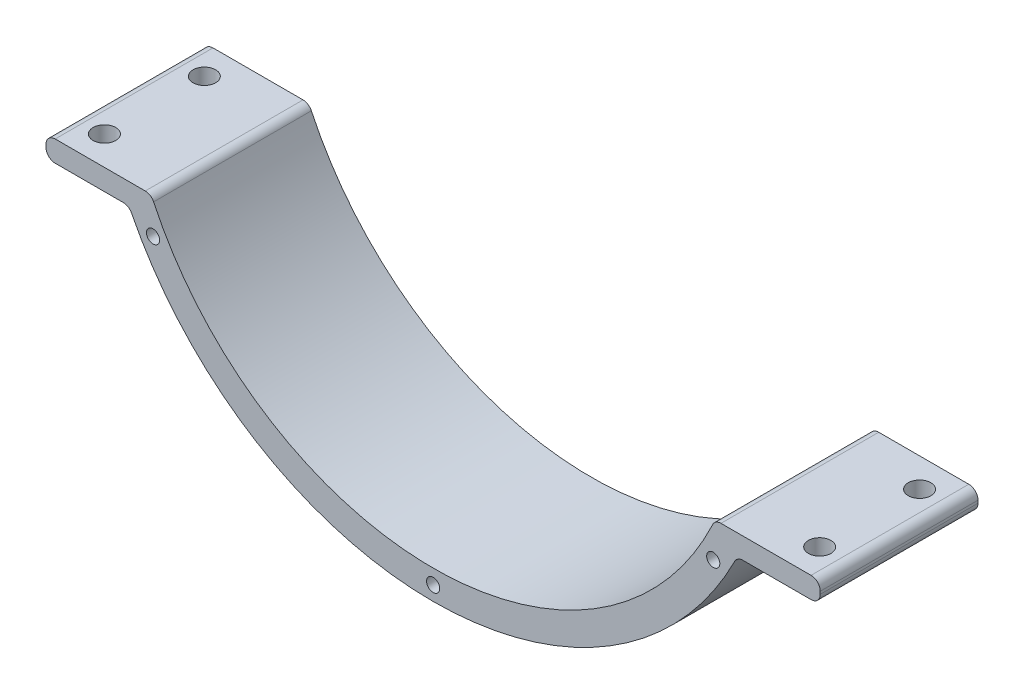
ISO-10303-21;
HEADER;
FILE_DESCRIPTION(('STEP AP214'),'2;1');
FILE_NAME('part.step','',(''),(''),'','','');
FILE_SCHEMA(('AUTOMOTIVE_DESIGN { 1 0 10303 214 1 1 1 1 }'));
ENDSEC;
DATA;
#1=APPLICATION_CONTEXT('core data for automotive mechanical design processes');
#2=APPLICATION_PROTOCOL_DEFINITION('international standard','automotive_design',2000,#1);
#3=PRODUCT_CONTEXT('',#1,'mechanical');
#4=PRODUCT('Part','Part','',(#3));
#5=PRODUCT_RELATED_PRODUCT_CATEGORY('part','',(#4));
#6=PRODUCT_DEFINITION_FORMATION('','',#4);
#7=PRODUCT_DEFINITION_CONTEXT('part definition',#1,'design');
#8=PRODUCT_DEFINITION('design','',#6,#7);
#9=PRODUCT_DEFINITION_SHAPE('','',#8);
#10=(LENGTH_UNIT() NAMED_UNIT(*) SI_UNIT(.MILLI.,.METRE.));
#11=(NAMED_UNIT(*) PLANE_ANGLE_UNIT() SI_UNIT($,.RADIAN.));
#12=(NAMED_UNIT(*) SI_UNIT($,.STERADIAN.) SOLID_ANGLE_UNIT());
#13=UNCERTAINTY_MEASURE_WITH_UNIT(LENGTH_MEASURE(1.E-05),#10,'distance_accuracy_value','');
#14=(GEOMETRIC_REPRESENTATION_CONTEXT(3) GLOBAL_UNCERTAINTY_ASSIGNED_CONTEXT((#13)) GLOBAL_UNIT_ASSIGNED_CONTEXT((#10,
#11,#12)) REPRESENTATION_CONTEXT('',''));
#15=CARTESIAN_POINT('',(0.,0.,0.));
#16=DIRECTION('',(0.,0.,1.));
#17=DIRECTION('',(1.,0.,0.));
#18=AXIS2_PLACEMENT_3D('',#15,#16,#17);
#19=CARTESIAN_POINT('',(0.,-24.,15.));
#20=DIRECTION('',(0.,-1.,0.));
#21=DIRECTION('',(1.,0.,0.));
#22=AXIS2_PLACEMENT_3D('',#19,#20,#21);
#23=PLANE('',#22);
#24=CARTESIAN_POINT('',(-68.,-24.,9.5));
#25=DIRECTION('',(0.,-1.,0.));
#26=DIRECTION('',(0.,0.,1.));
#27=AXIS2_PLACEMENT_3D('',#24,#25,#26);
#28=CIRCLE('',#27,2.15);
#29=CARTESIAN_POINT('',(-68.,-24.,11.65));
#30=VERTEX_POINT('',#29);
#31=EDGE_CURVE('E236',#30,#30,#28,.T.);
#32=ORIENTED_EDGE('',*,*,#31,.T.);
#33=EDGE_LOOP('',(#32));
#34=FACE_BOUND('',#33,.T.);
#35=DIRECTION('',(-1.,0.,0.));
#36=VECTOR('',#35,1.);
#37=CARTESIAN_POINT('',(0.,-24.,15.));
#38=LINE('',#37,#36);
#39=CARTESIAN_POINT('',(-54.7327612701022,-24.,15.));
#40=VERTEX_POINT('',#39);
#41=CARTESIAN_POINT('',(-71.8605764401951,-24.,15.));
#42=VERTEX_POINT('',#41);
#43=EDGE_CURVE('E374',#40,#42,#38,.T.);
#44=ORIENTED_EDGE('',*,*,#43,.F.);
#45=DIRECTION('',(0.,0.,1.));
#46=VECTOR('',#45,1.);
#47=CARTESIAN_POINT('',(-54.7327612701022,-24.,-15.));
#48=LINE('',#47,#46);
#49=CARTESIAN_POINT('',(-54.7327612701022,-24.,-15.));
#50=VERTEX_POINT('',#49);
#51=EDGE_CURVE('E244',#40,#50,#48,.F.);
#52=ORIENTED_EDGE('',*,*,#51,.T.);
#53=DIRECTION('',(-1.,0.,0.));
#54=VECTOR('',#53,1.);
#55=CARTESIAN_POINT('',(0.,-24.,-15.));
#56=LINE('',#55,#54);
#57=CARTESIAN_POINT('',(-71.8605764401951,-24.,-15.));
#58=VERTEX_POINT('',#57);
#59=EDGE_CURVE('E378',#50,#58,#56,.T.);
#60=ORIENTED_EDGE('',*,*,#59,.T.);
#61=DIRECTION('',(0.,0.,-1.));
#62=VECTOR('',#61,1.);
#63=CARTESIAN_POINT('',(-71.8605764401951,-24.,15.));
#64=LINE('',#63,#62);
#65=EDGE_CURVE('E230',#58,#42,#64,.F.);
#66=ORIENTED_EDGE('',*,*,#65,.T.);
#67=EDGE_LOOP('',(#44,#52,#60,#66));
#68=FACE_BOUND('',#67,.T.);
#69=CARTESIAN_POINT('',(-68.,-24.,-9.5));
#70=DIRECTION('',(0.,-1.,0.));
#71=DIRECTION('',(0.,0.,1.));
#72=AXIS2_PLACEMENT_3D('',#69,#70,#71);
#73=CIRCLE('',#72,2.15);
#74=CARTESIAN_POINT('',(-68.,-24.,-7.35));
#75=VERTEX_POINT('',#74);
#76=EDGE_CURVE('E241',#75,#75,#73,.T.);
#77=ORIENTED_EDGE('',*,*,#76,.T.);
#78=EDGE_LOOP('',(#77));
#79=FACE_BOUND('',#78,.T.);
#80=ADVANCED_FACE('F41',(#34,#68,#79),#23,.F.);
#81=CARTESIAN_POINT('',(0.,-28.,15.));
#82=DIRECTION('',(0.,1.,0.));
#83=DIRECTION('',(-1.,0.,0.));
#84=AXIS2_PLACEMENT_3D('',#81,#82,#83);
#85=PLANE('',#84);
#86=CARTESIAN_POINT('',(-68.,-28.,9.5));
#87=DIRECTION('',(0.,1.,0.));
#88=DIRECTION('',(-1.,0.,0.));
#89=AXIS2_PLACEMENT_3D('',#86,#87,#88);
#90=CIRCLE('',#89,2.15);
#91=CARTESIAN_POINT('',(-70.15,-28.,9.5));
#92=VERTEX_POINT('',#91);
#93=EDGE_CURVE('E231',#92,#92,#90,.F.);
#94=ORIENTED_EDGE('',*,*,#93,.F.);
#95=EDGE_LOOP('',(#94));
#96=FACE_BOUND('',#95,.T.);
#97=DIRECTION('',(1.,0.,0.));
#98=VECTOR('',#97,1.);
#99=CARTESIAN_POINT('',(0.,-28.,15.));
#100=LINE('',#99,#98);
#101=CARTESIAN_POINT('',(-71.8605764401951,-28.,15.));
#102=VERTEX_POINT('',#101);
#103=CARTESIAN_POINT('',(-58.9006592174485,-28.,15.));
#104=VERTEX_POINT('',#103);
#105=EDGE_CURVE('E370',#102,#104,#100,.T.);
#106=ORIENTED_EDGE('',*,*,#105,.F.);
#107=DIRECTION('',(0.,0.,-1.));
#108=VECTOR('',#107,1.);
#109=CARTESIAN_POINT('',(-71.8605764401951,-28.,15.));
#110=LINE('',#109,#108);
#111=CARTESIAN_POINT('',(-71.8605764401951,-28.,-15.));
#112=VERTEX_POINT('',#111);
#113=EDGE_CURVE('E289',#102,#112,#110,.T.);
#114=ORIENTED_EDGE('',*,*,#113,.T.);
#115=DIRECTION('',(1.,0.,0.));
#116=VECTOR('',#115,1.);
#117=CARTESIAN_POINT('',(0.,-28.,-15.));
#118=LINE('',#117,#116);
#119=CARTESIAN_POINT('',(-58.9006592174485,-28.,-15.));
#120=VERTEX_POINT('',#119);
#121=EDGE_CURVE('E371',#112,#120,#118,.T.);
#122=ORIENTED_EDGE('',*,*,#121,.T.);
#123=DIRECTION('',(0.,0.,1.));
#124=VECTOR('',#123,1.);
#125=CARTESIAN_POINT('',(-58.9006592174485,-28.,15.));
#126=LINE('',#125,#124);
#127=EDGE_CURVE('E219',#120,#104,#126,.T.);
#128=ORIENTED_EDGE('',*,*,#127,.T.);
#129=EDGE_LOOP('',(#106,#114,#122,#128));
#130=FACE_BOUND('',#129,.T.);
#131=CARTESIAN_POINT('',(-68.,-28.,-9.5));
#132=DIRECTION('',(0.,1.,0.));
#133=DIRECTION('',(-1.,0.,0.));
#134=AXIS2_PLACEMENT_3D('',#131,#132,#133);
#135=CIRCLE('',#134,2.15);
#136=CARTESIAN_POINT('',(-70.15,-28.,-9.5));
#137=VERTEX_POINT('',#136);
#138=EDGE_CURVE('E237',#137,#137,#135,.F.);
#139=ORIENTED_EDGE('',*,*,#138,.F.);
#140=EDGE_LOOP('',(#139));
#141=FACE_BOUND('',#140,.T.);
#142=ADVANCED_FACE('F410',(#96,#130,#141),#85,.F.);
#143=CARTESIAN_POINT('',(0.,0.,15.));
#144=DIRECTION('',(0.,0.,-1.));
#145=DIRECTION('',(-1.,0.,0.));
#146=AXIS2_PLACEMENT_3D('',#143,#144,#145);
#147=CYLINDRICAL_SURFACE('',#146,58.7375);
#148=CARTESIAN_POINT('',(0.,0.,-15.));
#149=DIRECTION('',(0.,0.,1.));
#150=DIRECTION('',(1.,0.,0.));
#151=AXIS2_PLACEMENT_3D('',#148,#149,#150);
#152=CIRCLE('',#151,58.7375);
#153=CARTESIAN_POINT('',(-53.1492550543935,-25.0050113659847,-15.));
#154=VERTEX_POINT('',#153);
#155=CARTESIAN_POINT('',(53.1492550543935,-25.0050113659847,-15.));
#156=VERTEX_POINT('',#155);
#157=EDGE_CURVE('E198',#154,#156,#152,.T.);
#158=ORIENTED_EDGE('',*,*,#157,.F.);
#159=DIRECTION('',(0.,0.,-1.));
#160=VECTOR('',#159,1.);
#161=CARTESIAN_POINT('',(-53.1492550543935,-25.0050113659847,15.));
#162=LINE('',#161,#160);
#163=CARTESIAN_POINT('',(-53.1492550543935,-25.0050113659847,15.));
#164=VERTEX_POINT('',#163);
#165=EDGE_CURVE('E269',#154,#164,#162,.F.);
#166=ORIENTED_EDGE('',*,*,#165,.T.);
#167=CARTESIAN_POINT('',(0.,0.,15.));
#168=DIRECTION('',(0.,0.,1.));
#169=DIRECTION('',(1.,0.,0.));
#170=AXIS2_PLACEMENT_3D('',#167,#168,#169);
#171=CIRCLE('',#170,58.7375);
#172=CARTESIAN_POINT('',(53.1492550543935,-25.0050113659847,15.));
#173=VERTEX_POINT('',#172);
#174=EDGE_CURVE('E188',#164,#173,#171,.T.);
#175=ORIENTED_EDGE('',*,*,#174,.T.);
#176=DIRECTION('',(0.,0.,-1.));
#177=VECTOR('',#176,1.);
#178=CARTESIAN_POINT('',(53.1492550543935,-25.0050113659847,15.));
#179=LINE('',#178,#177);
#180=EDGE_CURVE('E265',#173,#156,#179,.T.);
#181=ORIENTED_EDGE('',*,*,#180,.T.);
#182=EDGE_LOOP('',(#158,#166,#175,#181));
#183=FACE_BOUND('',#182,.T.);
#184=ADVANCED_FACE('F332',(#183),#147,.F.);
#185=CARTESIAN_POINT('',(0.,0.,-15.));
#186=DIRECTION('',(0.,0.,1.));
#187=DIRECTION('',(1.,0.,0.));
#188=AXIS2_PLACEMENT_3D('',#185,#186,#187);
#189=PLANE('',#188);
#190=CARTESIAN_POINT('',(-53.2648924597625,-30.7424987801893,-15.));
#191=DIRECTION('',(0.,0.,1.));
#192=DIRECTION('',(1.,0.,0.));
#193=AXIS2_PLACEMENT_3D('',#190,#191,#192);
#194=CIRCLE('',#193,1.24999999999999);
#195=CARTESIAN_POINT('',(-52.0148924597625,-30.7424987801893,-15.));
#196=VERTEX_POINT('',#195);
#197=EDGE_CURVE('E382',#196,#196,#194,.T.);
#198=ORIENTED_EDGE('',*,*,#197,.T.);
#199=EDGE_LOOP('',(#198));
#200=FACE_BOUND('',#199,.T.);
#201=CARTESIAN_POINT('',(0.,-61.5,-15.));
#202=DIRECTION('',(0.,0.,1.));
#203=DIRECTION('',(1.,0.,0.));
#204=AXIS2_PLACEMENT_3D('',#201,#202,#203);
#205=CIRCLE('',#204,1.24999999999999);
#206=CARTESIAN_POINT('',(1.24999999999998,-61.5,-15.));
#207=VERTEX_POINT('',#206);
#208=EDGE_CURVE('E208',#207,#207,#205,.T.);
#209=ORIENTED_EDGE('',*,*,#208,.T.);
#210=EDGE_LOOP('',(#209));
#211=FACE_BOUND('',#210,.T.);
#212=CARTESIAN_POINT('',(53.2648924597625,-30.7424987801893,-15.));
#213=DIRECTION('',(0.,0.,1.));
#214=DIRECTION('',(1.,0.,0.));
#215=AXIS2_PLACEMENT_3D('',#212,#213,#214);
#216=CIRCLE('',#215,1.24999999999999);
#217=CARTESIAN_POINT('',(54.5148924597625,-30.7424987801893,-15.));
#218=VERTEX_POINT('',#217);
#219=EDGE_CURVE('E345',#218,#218,#216,.T.);
#220=ORIENTED_EDGE('',*,*,#219,.T.);
#221=EDGE_LOOP('',(#220));
#222=FACE_BOUND('',#221,.T.);
#223=ORIENTED_EDGE('',*,*,#59,.F.);
#224=CARTESIAN_POINT('',(-54.7327612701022,-25.75,-15.));
#225=DIRECTION('',(0.,0.,1.));
#226=DIRECTION('',(1.,0.,0.));
#227=AXIS2_PLACEMENT_3D('',#224,#225,#226);
#228=CIRCLE('',#227,1.75);
#229=EDGE_CURVE('E262',#50,#154,#228,.F.);
#230=ORIENTED_EDGE('',*,*,#229,.T.);
#231=ORIENTED_EDGE('',*,*,#157,.T.);
#232=CARTESIAN_POINT('',(54.7327612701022,-25.75,-15.));
#233=DIRECTION('',(0.,0.,1.));
#234=DIRECTION('',(1.,0.,0.));
#235=AXIS2_PLACEMENT_3D('',#232,#233,#234);
#236=CIRCLE('',#235,1.75);
#237=CARTESIAN_POINT('',(54.7327612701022,-24.,-15.));
#238=VERTEX_POINT('',#237);
#239=EDGE_CURVE('E248',#156,#238,#236,.F.);
#240=ORIENTED_EDGE('',*,*,#239,.T.);
#241=DIRECTION('',(1.,0.,0.));
#242=VECTOR('',#241,1.);
#243=CARTESIAN_POINT('',(0.,-24.,-15.));
#244=LINE('',#243,#242);
#245=CARTESIAN_POINT('',(71.8605764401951,-24.,-15.));
#246=VERTEX_POINT('',#245);
#247=EDGE_CURVE('E317',#238,#246,#244,.T.);
#248=ORIENTED_EDGE('',*,*,#247,.T.);
#249=CARTESIAN_POINT('',(71.8605764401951,-25.75,-15.));
#250=DIRECTION('',(0.,0.,1.));
#251=DIRECTION('',(1.,0.,0.));
#252=AXIS2_PLACEMENT_3D('',#249,#250,#251);
#253=CIRCLE('',#252,1.75);
#254=CARTESIAN_POINT('',(73.6105764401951,-25.75,-15.));
#255=VERTEX_POINT('',#254);
#256=EDGE_CURVE('E251',#246,#255,#253,.F.);
#257=ORIENTED_EDGE('',*,*,#256,.T.);
#258=DIRECTION('',(0.,-1.,0.));
#259=VECTOR('',#258,1.);
#260=CARTESIAN_POINT('',(73.6105764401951,0.,-15.));
#261=LINE('',#260,#259);
#262=CARTESIAN_POINT('',(73.6105764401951,-26.25,-15.));
#263=VERTEX_POINT('',#262);
#264=EDGE_CURVE('E170',#255,#263,#261,.T.);
#265=ORIENTED_EDGE('',*,*,#264,.T.);
#266=CARTESIAN_POINT('',(71.8605764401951,-26.25,-15.));
#267=DIRECTION('',(0.,0.,1.));
#268=DIRECTION('',(1.,0.,0.));
#269=AXIS2_PLACEMENT_3D('',#266,#267,#268);
#270=CIRCLE('',#269,1.75);
#271=CARTESIAN_POINT('',(71.8605764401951,-28.,-15.));
#272=VERTEX_POINT('',#271);
#273=EDGE_CURVE('E165',#263,#272,#270,.F.);
#274=ORIENTED_EDGE('',*,*,#273,.T.);
#275=DIRECTION('',(-1.,0.,0.));
#276=VECTOR('',#275,1.);
#277=CARTESIAN_POINT('',(0.,-28.,-15.));
#278=LINE('',#277,#276);
#279=CARTESIAN_POINT('',(58.9006592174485,-28.,-15.));
#280=VERTEX_POINT('',#279);
#281=EDGE_CURVE('E157',#272,#280,#278,.T.);
#282=ORIENTED_EDGE('',*,*,#281,.T.);
#283=CARTESIAN_POINT('',(58.9006592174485,-29.75,-15.));
#284=DIRECTION('',(0.,0.,1.));
#285=DIRECTION('',(1.,0.,0.));
#286=AXIS2_PLACEMENT_3D('',#283,#284,#285);
#287=CIRCLE('',#286,1.75);
#288=CARTESIAN_POINT('',(57.338603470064,-28.9610248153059,-15.));
#289=VERTEX_POINT('',#288);
#290=EDGE_CURVE('E162',#280,#289,#287,.T.);
#291=ORIENTED_EDGE('',*,*,#290,.T.);
#292=CARTESIAN_POINT('',(0.,0.,-15.));
#293=DIRECTION('',(0.,0.,1.));
#294=DIRECTION('',(1.,0.,0.));
#295=AXIS2_PLACEMENT_3D('',#292,#293,#294);
#296=CIRCLE('',#295,64.2375);
#297=CARTESIAN_POINT('',(-57.338603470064,-28.9610248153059,-15.));
#298=VERTEX_POINT('',#297);
#299=EDGE_CURVE('E171',#298,#289,#296,.T.);
#300=ORIENTED_EDGE('',*,*,#299,.F.);
#301=CARTESIAN_POINT('',(-58.9006592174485,-29.75,-15.));
#302=DIRECTION('',(0.,0.,1.));
#303=DIRECTION('',(1.,0.,0.));
#304=AXIS2_PLACEMENT_3D('',#301,#302,#303);
#305=CIRCLE('',#304,1.75);
#306=EDGE_CURVE('E223',#298,#120,#305,.T.);
#307=ORIENTED_EDGE('',*,*,#306,.T.);
#308=ORIENTED_EDGE('',*,*,#121,.F.);
#309=CARTESIAN_POINT('',(-71.8605764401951,-26.25,-15.));
#310=DIRECTION('',(0.,0.,1.));
#311=DIRECTION('',(1.,0.,0.));
#312=AXIS2_PLACEMENT_3D('',#309,#310,#311);
#313=CIRCLE('',#312,1.75);
#314=CARTESIAN_POINT('',(-73.6105764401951,-26.25,-15.));
#315=VERTEX_POINT('',#314);
#316=EDGE_CURVE('E259',#112,#315,#313,.F.);
#317=ORIENTED_EDGE('',*,*,#316,.T.);
#318=DIRECTION('',(0.,-1.,0.));
#319=VECTOR('',#318,1.);
#320=CARTESIAN_POINT('',(-73.6105764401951,0.,-15.));
#321=LINE('',#320,#319);
#322=CARTESIAN_POINT('',(-73.6105764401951,-25.75,-15.));
#323=VERTEX_POINT('',#322);
#324=EDGE_CURVE('E375',#323,#315,#321,.T.);
#325=ORIENTED_EDGE('',*,*,#324,.F.);
#326=CARTESIAN_POINT('',(-71.8605764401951,-25.75,-15.));
#327=DIRECTION('',(0.,0.,1.));
#328=DIRECTION('',(1.,0.,0.));
#329=AXIS2_PLACEMENT_3D('',#326,#327,#328);
#330=CIRCLE('',#329,1.75);
#331=EDGE_CURVE('E256',#323,#58,#330,.F.);
#332=ORIENTED_EDGE('',*,*,#331,.T.);
#333=EDGE_LOOP('',(#223,#230,#231,#240,#248,#257,#265,#274,#282,#291,#300,#307,#308,#317,#325,#332));
#334=FACE_BOUND('',#333,.T.);
#335=ADVANCED_FACE('F160',(#200,#211,#222,#334),#189,.F.);
#336=CARTESIAN_POINT('',(0.,-24.,15.));
#337=DIRECTION('',(0.,1.,0.));
#338=DIRECTION('',(0.,0.,1.));
#339=AXIS2_PLACEMENT_3D('',#336,#337,#338);
#340=PLANE('',#339);
#341=CARTESIAN_POINT('',(68.,-24.,-9.5));
#342=DIRECTION('',(0.,1.,0.));
#343=DIRECTION('',(0.,0.,1.));
#344=AXIS2_PLACEMENT_3D('',#341,#342,#343);
#345=CIRCLE('',#344,2.15);
#346=CARTESIAN_POINT('',(68.,-24.,-7.35));
#347=VERTEX_POINT('',#346);
#348=EDGE_CURVE('E214',#347,#347,#345,.T.);
#349=ORIENTED_EDGE('',*,*,#348,.F.);
#350=EDGE_LOOP('',(#349));
#351=FACE_BOUND('',#350,.T.);
#352=CARTESIAN_POINT('',(68.,-24.,9.5));
#353=DIRECTION('',(0.,1.,0.));
#354=DIRECTION('',(0.,0.,1.));
#355=AXIS2_PLACEMENT_3D('',#352,#353,#354);
#356=CIRCLE('',#355,2.15);
#357=CARTESIAN_POINT('',(68.,-24.,11.65));
#358=VERTEX_POINT('',#357);
#359=EDGE_CURVE('E209',#358,#358,#356,.T.);
#360=ORIENTED_EDGE('',*,*,#359,.F.);
#361=EDGE_LOOP('',(#360));
#362=FACE_BOUND('',#361,.T.);
#363=DIRECTION('',(1.,0.,0.));
#364=VECTOR('',#363,1.);
#365=CARTESIAN_POINT('',(0.,-24.,15.));
#366=LINE('',#365,#364);
#367=CARTESIAN_POINT('',(54.7327612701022,-24.,15.));
#368=VERTEX_POINT('',#367);
#369=CARTESIAN_POINT('',(71.8605764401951,-24.,15.));
#370=VERTEX_POINT('',#369);
#371=EDGE_CURVE('E195',#368,#370,#366,.T.);
#372=ORIENTED_EDGE('',*,*,#371,.T.);
#373=DIRECTION('',(0.,0.,-1.));
#374=VECTOR('',#373,1.);
#375=CARTESIAN_POINT('',(71.8605764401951,-24.,15.));
#376=LINE('',#375,#374);
#377=EDGE_CURVE('E11',#370,#246,#376,.T.);
#378=ORIENTED_EDGE('',*,*,#377,.T.);
#379=ORIENTED_EDGE('',*,*,#247,.F.);
#380=DIRECTION('',(0.,0.,-1.));
#381=VECTOR('',#380,1.);
#382=CARTESIAN_POINT('',(54.7327612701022,-24.,15.));
#383=LINE('',#382,#381);
#384=EDGE_CURVE('E50',#238,#368,#383,.F.);
#385=ORIENTED_EDGE('',*,*,#384,.T.);
#386=EDGE_LOOP('',(#372,#378,#379,#385));
#387=FACE_BOUND('',#386,.T.);
#388=ADVANCED_FACE('F314',(#351,#362,#387),#340,.T.);
#389=CARTESIAN_POINT('',(73.6105764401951,0.,15.));
#390=DIRECTION('',(1.,0.,0.));
#391=DIRECTION('',(0.,0.,-1.));
#392=AXIS2_PLACEMENT_3D('',#389,#390,#391);
#393=PLANE('',#392);
#394=DIRECTION('',(0.,-1.,0.));
#395=VECTOR('',#394,1.);
#396=CARTESIAN_POINT('',(73.6105764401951,0.,15.));
#397=LINE('',#396,#395);
#398=CARTESIAN_POINT('',(73.6105764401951,-25.75,15.));
#399=VERTEX_POINT('',#398);
#400=CARTESIAN_POINT('',(73.6105764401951,-26.25,15.));
#401=VERTEX_POINT('',#400);
#402=EDGE_CURVE('E326',#399,#401,#397,.T.);
#403=ORIENTED_EDGE('',*,*,#402,.T.);
#404=DIRECTION('',(0.,0.,-1.));
#405=VECTOR('',#404,1.);
#406=CARTESIAN_POINT('',(73.6105764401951,-26.25,15.));
#407=LINE('',#406,#405);
#408=EDGE_CURVE('E302',#401,#263,#407,.T.);
#409=ORIENTED_EDGE('',*,*,#408,.T.);
#410=ORIENTED_EDGE('',*,*,#264,.F.);
#411=DIRECTION('',(0.,0.,-1.));
#412=VECTOR('',#411,1.);
#413=CARTESIAN_POINT('',(73.6105764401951,-25.75,15.));
#414=LINE('',#413,#412);
#415=EDGE_CURVE('E299',#255,#399,#414,.F.);
#416=ORIENTED_EDGE('',*,*,#415,.T.);
#417=EDGE_LOOP('',(#403,#409,#410,#416));
#418=FACE_BOUND('',#417,.T.);
#419=ADVANCED_FACE('F431',(#418),#393,.T.);
#420=CARTESIAN_POINT('',(0.,-28.,15.));
#421=DIRECTION('',(0.,-1.,0.));
#422=DIRECTION('',(1.,0.,0.));
#423=AXIS2_PLACEMENT_3D('',#420,#421,#422);
#424=PLANE('',#423);
#425=CARTESIAN_POINT('',(68.,-28.,-9.5));
#426=DIRECTION('',(0.,-1.,0.));
#427=DIRECTION('',(1.,0.,0.));
#428=AXIS2_PLACEMENT_3D('',#425,#426,#427);
#429=CIRCLE('',#428,2.15);
#430=CARTESIAN_POINT('',(70.15,-28.,-9.5));
#431=VERTEX_POINT('',#430);
#432=EDGE_CURVE('E210',#431,#431,#429,.T.);
#433=ORIENTED_EDGE('',*,*,#432,.F.);
#434=EDGE_LOOP('',(#433));
#435=FACE_BOUND('',#434,.T.);
#436=CARTESIAN_POINT('',(68.,-28.,9.5));
#437=DIRECTION('',(0.,-1.,0.));
#438=DIRECTION('',(1.,0.,0.));
#439=AXIS2_PLACEMENT_3D('',#436,#437,#438);
#440=CIRCLE('',#439,2.15);
#441=CARTESIAN_POINT('',(70.15,-28.,9.5));
#442=VERTEX_POINT('',#441);
#443=EDGE_CURVE('E204',#442,#442,#440,.T.);
#444=ORIENTED_EDGE('',*,*,#443,.F.);
#445=EDGE_LOOP('',(#444));
#446=FACE_BOUND('',#445,.T.);
#447=ORIENTED_EDGE('',*,*,#281,.F.);
#448=DIRECTION('',(0.,0.,-1.));
#449=VECTOR('',#448,1.);
#450=CARTESIAN_POINT('',(71.8605764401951,-28.,15.));
#451=LINE('',#450,#449);
#452=CARTESIAN_POINT('',(71.8605764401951,-28.,15.));
#453=VERTEX_POINT('',#452);
#454=EDGE_CURVE('E306',#272,#453,#451,.F.);
#455=ORIENTED_EDGE('',*,*,#454,.T.);
#456=DIRECTION('',(-1.,0.,0.));
#457=VECTOR('',#456,1.);
#458=CARTESIAN_POINT('',(0.,-28.,15.));
#459=LINE('',#458,#457);
#460=CARTESIAN_POINT('',(58.9006592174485,-28.,15.));
#461=VERTEX_POINT('',#460);
#462=EDGE_CURVE('E185',#453,#461,#459,.T.);
#463=ORIENTED_EDGE('',*,*,#462,.T.);
#464=DIRECTION('',(0.,0.,-1.));
#465=VECTOR('',#464,1.);
#466=CARTESIAN_POINT('',(58.9006592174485,-28.,15.));
#467=LINE('',#466,#465);
#468=EDGE_CURVE('E177',#461,#280,#467,.T.);
#469=ORIENTED_EDGE('',*,*,#468,.T.);
#470=EDGE_LOOP('',(#447,#455,#463,#469));
#471=FACE_BOUND('',#470,.T.);
#472=ADVANCED_FACE('F183',(#435,#446,#471),#424,.T.);
#473=CARTESIAN_POINT('',(0.,0.,15.));
#474=DIRECTION('',(0.,0.,-1.));
#475=DIRECTION('',(-1.,0.,0.));
#476=AXIS2_PLACEMENT_3D('',#473,#474,#475);
#477=CYLINDRICAL_SURFACE('',#476,64.2375);
#478=CARTESIAN_POINT('',(0.,0.,15.));
#479=DIRECTION('',(0.,0.,1.));
#480=DIRECTION('',(1.,0.,0.));
#481=AXIS2_PLACEMENT_3D('',#478,#479,#480);
#482=CIRCLE('',#481,64.2375);
#483=CARTESIAN_POINT('',(-57.338603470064,-28.9610248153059,15.));
#484=VERTEX_POINT('',#483);
#485=CARTESIAN_POINT('',(57.338603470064,-28.9610248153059,15.));
#486=VERTEX_POINT('',#485);
#487=EDGE_CURVE('E335',#484,#486,#482,.T.);
#488=ORIENTED_EDGE('',*,*,#487,.F.);
#489=DIRECTION('',(0.,0.,-1.));
#490=VECTOR('',#489,1.);
#491=CARTESIAN_POINT('',(-57.338603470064,-28.961024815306,15.));
#492=LINE('',#491,#490);
#493=EDGE_CURVE('E215',#484,#298,#492,.T.);
#494=ORIENTED_EDGE('',*,*,#493,.T.);
#495=ORIENTED_EDGE('',*,*,#299,.T.);
#496=DIRECTION('',(0.,0.,-1.));
#497=VECTOR('',#496,1.);
#498=CARTESIAN_POINT('',(57.338603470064,-28.9610248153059,15.));
#499=LINE('',#498,#497);
#500=EDGE_CURVE('E179',#289,#486,#499,.F.);
#501=ORIENTED_EDGE('',*,*,#500,.T.);
#502=EDGE_LOOP('',(#488,#494,#495,#501));
#503=FACE_BOUND('',#502,.T.);
#504=ADVANCED_FACE('F443',(#503),#477,.T.);
#505=CARTESIAN_POINT('',(0.,0.,15.));
#506=DIRECTION('',(0.,0.,1.));
#507=DIRECTION('',(1.,0.,0.));
#508=AXIS2_PLACEMENT_3D('',#505,#506,#507);
#509=PLANE('',#508);
#510=CARTESIAN_POINT('',(0.,-61.5,15.));
#511=DIRECTION('',(0.,0.,1.));
#512=DIRECTION('',(1.,0.,0.));
#513=AXIS2_PLACEMENT_3D('',#510,#511,#512);
#514=CIRCLE('',#513,1.24999999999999);
#515=CARTESIAN_POINT('',(1.24999999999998,-61.5,15.));
#516=VERTEX_POINT('',#515);
#517=EDGE_CURVE('E203',#516,#516,#514,.T.);
#518=ORIENTED_EDGE('',*,*,#517,.F.);
#519=EDGE_LOOP('',(#518));
#520=FACE_BOUND('',#519,.T.);
#521=CARTESIAN_POINT('',(-53.2648924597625,-30.7424987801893,15.));
#522=DIRECTION('',(0.,0.,1.));
#523=DIRECTION('',(1.,0.,0.));
#524=AXIS2_PLACEMENT_3D('',#521,#522,#523);
#525=CIRCLE('',#524,1.24999999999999);
#526=CARTESIAN_POINT('',(-52.0148924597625,-30.7424987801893,15.));
#527=VERTEX_POINT('',#526);
#528=EDGE_CURVE('E235',#527,#527,#525,.T.);
#529=ORIENTED_EDGE('',*,*,#528,.F.);
#530=EDGE_LOOP('',(#529));
#531=FACE_BOUND('',#530,.T.);
#532=ORIENTED_EDGE('',*,*,#174,.F.);
#533=CARTESIAN_POINT('',(-54.7327612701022,-25.75,15.));
#534=DIRECTION('',(0.,0.,1.));
#535=DIRECTION('',(1.,0.,0.));
#536=AXIS2_PLACEMENT_3D('',#533,#534,#535);
#537=CIRCLE('',#536,1.75);
#538=EDGE_CURVE('E286',#164,#40,#537,.T.);
#539=ORIENTED_EDGE('',*,*,#538,.T.);
#540=ORIENTED_EDGE('',*,*,#43,.T.);
#541=CARTESIAN_POINT('',(-71.8605764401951,-25.75,15.));
#542=DIRECTION('',(0.,0.,1.));
#543=DIRECTION('',(1.,0.,0.));
#544=AXIS2_PLACEMENT_3D('',#541,#542,#543);
#545=CIRCLE('',#544,1.75);
#546=CARTESIAN_POINT('',(-73.6105764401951,-25.75,15.));
#547=VERTEX_POINT('',#546);
#548=EDGE_CURVE('E64',#42,#547,#545,.T.);
#549=ORIENTED_EDGE('',*,*,#548,.T.);
#550=DIRECTION('',(0.,-1.,0.));
#551=VECTOR('',#550,1.);
#552=CARTESIAN_POINT('',(-73.6105764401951,0.,15.));
#553=LINE('',#552,#551);
#554=CARTESIAN_POINT('',(-73.6105764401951,-26.25,15.));
#555=VERTEX_POINT('',#554);
#556=EDGE_CURVE('E384',#547,#555,#553,.T.);
#557=ORIENTED_EDGE('',*,*,#556,.T.);
#558=CARTESIAN_POINT('',(-71.8605764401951,-26.25,15.));
#559=DIRECTION('',(0.,0.,1.));
#560=DIRECTION('',(1.,0.,0.));
#561=AXIS2_PLACEMENT_3D('',#558,#559,#560);
#562=CIRCLE('',#561,1.75);
#563=EDGE_CURVE('E283',#555,#102,#562,.T.);
#564=ORIENTED_EDGE('',*,*,#563,.T.);
#565=ORIENTED_EDGE('',*,*,#105,.T.);
#566=CARTESIAN_POINT('',(-58.9006592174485,-29.75,15.));
#567=DIRECTION('',(0.,0.,1.));
#568=DIRECTION('',(1.,0.,0.));
#569=AXIS2_PLACEMENT_3D('',#566,#567,#568);
#570=CIRCLE('',#569,1.75);
#571=EDGE_CURVE('E227',#104,#484,#570,.F.);
#572=ORIENTED_EDGE('',*,*,#571,.T.);
#573=ORIENTED_EDGE('',*,*,#487,.T.);
#574=CARTESIAN_POINT('',(58.9006592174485,-29.75,15.));
#575=DIRECTION('',(0.,0.,1.));
#576=DIRECTION('',(1.,0.,0.));
#577=AXIS2_PLACEMENT_3D('',#574,#575,#576);
#578=CIRCLE('',#577,1.75);
#579=EDGE_CURVE('E181',#486,#461,#578,.F.);
#580=ORIENTED_EDGE('',*,*,#579,.T.);
#581=ORIENTED_EDGE('',*,*,#462,.F.);
#582=CARTESIAN_POINT('',(71.8605764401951,-26.25,15.));
#583=DIRECTION('',(0.,0.,1.));
#584=DIRECTION('',(1.,0.,0.));
#585=AXIS2_PLACEMENT_3D('',#582,#583,#584);
#586=CIRCLE('',#585,1.75);
#587=EDGE_CURVE('E278',#453,#401,#586,.T.);
#588=ORIENTED_EDGE('',*,*,#587,.T.);
#589=ORIENTED_EDGE('',*,*,#402,.F.);
#590=CARTESIAN_POINT('',(71.8605764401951,-25.75,15.));
#591=DIRECTION('',(0.,0.,1.));
#592=DIRECTION('',(1.,0.,0.));
#593=AXIS2_PLACEMENT_3D('',#590,#591,#592);
#594=CIRCLE('',#593,1.75);
#595=EDGE_CURVE('E275',#399,#370,#594,.T.);
#596=ORIENTED_EDGE('',*,*,#595,.T.);
#597=ORIENTED_EDGE('',*,*,#371,.F.);
#598=CARTESIAN_POINT('',(54.7327612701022,-25.75,15.));
#599=DIRECTION('',(0.,0.,1.));
#600=DIRECTION('',(1.,0.,0.));
#601=AXIS2_PLACEMENT_3D('',#598,#599,#600);
#602=CIRCLE('',#601,1.75);
#603=EDGE_CURVE('E272',#368,#173,#602,.T.);
#604=ORIENTED_EDGE('',*,*,#603,.T.);
#605=EDGE_LOOP('',(#532,#539,#540,#549,#557,#564,#565,#572,#573,#580,#581,#588,#589,#596,#597,#604));
#606=FACE_BOUND('',#605,.T.);
#607=CARTESIAN_POINT('',(53.2648924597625,-30.7424987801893,15.));
#608=DIRECTION('',(0.,0.,1.));
#609=DIRECTION('',(1.,0.,0.));
#610=AXIS2_PLACEMENT_3D('',#607,#608,#609);
#611=CIRCLE('',#610,1.24999999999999);
#612=CARTESIAN_POINT('',(54.5148924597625,-30.7424987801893,15.));
#613=VERTEX_POINT('',#612);
#614=EDGE_CURVE('E354',#613,#613,#611,.T.);
#615=ORIENTED_EDGE('',*,*,#614,.F.);
#616=EDGE_LOOP('',(#615));
#617=FACE_BOUND('',#616,.T.);
#618=ADVANCED_FACE('F321',(#520,#531,#606,#617),#509,.T.);
#619=CARTESIAN_POINT('',(58.9006592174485,-29.75,15.));
#620=DIRECTION('',(0.,0.,-1.));
#621=DIRECTION('',(-1.,0.,0.));
#622=AXIS2_PLACEMENT_3D('',#619,#620,#621);
#623=CYLINDRICAL_SURFACE('',#622,1.75);
#624=ORIENTED_EDGE('',*,*,#579,.F.);
#625=ORIENTED_EDGE('',*,*,#500,.F.);
#626=ORIENTED_EDGE('',*,*,#290,.F.);
#627=ORIENTED_EDGE('',*,*,#468,.F.);
#628=EDGE_LOOP('',(#624,#625,#626,#627));
#629=FACE_BOUND('',#628,.T.);
#630=ADVANCED_FACE('F176',(#629),#623,.F.);
#631=CARTESIAN_POINT('',(53.2648924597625,-30.7424987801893,15.));
#632=DIRECTION('',(0.,0.,1.));
#633=DIRECTION('',(1.,0.,0.));
#634=AXIS2_PLACEMENT_3D('',#631,#632,#633);
#635=CYLINDRICAL_SURFACE('',#634,1.24999999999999);
#636=ORIENTED_EDGE('',*,*,#219,.F.);
#637=EDGE_LOOP('',(#636));
#638=FACE_BOUND('',#637,.T.);
#639=ORIENTED_EDGE('',*,*,#614,.T.);
#640=EDGE_LOOP('',(#639));
#641=FACE_BOUND('',#640,.T.);
#642=ADVANCED_FACE('F450',(#638,#641),#635,.F.);
#643=CARTESIAN_POINT('',(0.,-61.5,15.));
#644=DIRECTION('',(0.,0.,1.));
#645=DIRECTION('',(1.,0.,0.));
#646=AXIS2_PLACEMENT_3D('',#643,#644,#645);
#647=CYLINDRICAL_SURFACE('',#646,1.24999999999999);
#648=ORIENTED_EDGE('',*,*,#208,.F.);
#649=EDGE_LOOP('',(#648));
#650=FACE_BOUND('',#649,.T.);
#651=ORIENTED_EDGE('',*,*,#517,.T.);
#652=EDGE_LOOP('',(#651));
#653=FACE_BOUND('',#652,.T.);
#654=ADVANCED_FACE('F507',(#650,#653),#647,.F.);
#655=CARTESIAN_POINT('',(68.,-34.,9.5));
#656=DIRECTION('',(0.,1.,0.));
#657=DIRECTION('',(0.,0.,1.));
#658=AXIS2_PLACEMENT_3D('',#655,#656,#657);
#659=CYLINDRICAL_SURFACE('',#658,2.15);
#660=ORIENTED_EDGE('',*,*,#443,.T.);
#661=EDGE_LOOP('',(#660));
#662=FACE_BOUND('',#661,.T.);
#663=ORIENTED_EDGE('',*,*,#359,.T.);
#664=EDGE_LOOP('',(#663));
#665=FACE_BOUND('',#664,.T.);
#666=ADVANCED_FACE('F501',(#662,#665),#659,.F.);
#667=CARTESIAN_POINT('',(68.,-34.,-9.5));
#668=DIRECTION('',(0.,1.,0.));
#669=DIRECTION('',(0.,0.,1.));
#670=AXIS2_PLACEMENT_3D('',#667,#668,#669);
#671=CYLINDRICAL_SURFACE('',#670,2.15);
#672=ORIENTED_EDGE('',*,*,#432,.T.);
#673=EDGE_LOOP('',(#672));
#674=FACE_BOUND('',#673,.T.);
#675=ORIENTED_EDGE('',*,*,#348,.T.);
#676=EDGE_LOOP('',(#675));
#677=FACE_BOUND('',#676,.T.);
#678=ADVANCED_FACE('F497',(#674,#677),#671,.F.);
#679=CARTESIAN_POINT('',(-73.6105764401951,0.,15.));
#680=DIRECTION('',(1.,0.,0.));
#681=DIRECTION('',(0.,1.,0.));
#682=AXIS2_PLACEMENT_3D('',#679,#680,#681);
#683=PLANE('',#682);
#684=ORIENTED_EDGE('',*,*,#324,.T.);
#685=DIRECTION('',(0.,0.,-1.));
#686=VECTOR('',#685,1.);
#687=CARTESIAN_POINT('',(-73.6105764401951,-26.25,15.));
#688=LINE('',#687,#686);
#689=EDGE_CURVE('E57',#315,#555,#688,.F.);
#690=ORIENTED_EDGE('',*,*,#689,.T.);
#691=ORIENTED_EDGE('',*,*,#556,.F.);
#692=DIRECTION('',(0.,0.,-1.));
#693=VECTOR('',#692,1.);
#694=CARTESIAN_POINT('',(-73.6105764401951,-25.75,15.));
#695=LINE('',#694,#693);
#696=EDGE_CURVE('E293',#547,#323,#695,.T.);
#697=ORIENTED_EDGE('',*,*,#696,.T.);
#698=EDGE_LOOP('',(#684,#690,#691,#697));
#699=FACE_BOUND('',#698,.T.);
#700=ADVANCED_FACE('F455',(#699),#683,.F.);
#701=CARTESIAN_POINT('',(-58.9006592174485,-29.75,15.));
#702=DIRECTION('',(0.,0.,-1.));
#703=DIRECTION('',(-1.,0.,0.));
#704=AXIS2_PLACEMENT_3D('',#701,#702,#703);
#705=CYLINDRICAL_SURFACE('',#704,1.75);
#706=ORIENTED_EDGE('',*,*,#571,.F.);
#707=ORIENTED_EDGE('',*,*,#127,.F.);
#708=ORIENTED_EDGE('',*,*,#306,.F.);
#709=ORIENTED_EDGE('',*,*,#493,.F.);
#710=EDGE_LOOP('',(#706,#707,#708,#709));
#711=FACE_BOUND('',#710,.T.);
#712=ADVANCED_FACE('F451',(#711),#705,.F.);
#713=CARTESIAN_POINT('',(-53.2648924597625,-30.7424987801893,15.));
#714=DIRECTION('',(0.,0.,1.));
#715=DIRECTION('',(1.,0.,0.));
#716=AXIS2_PLACEMENT_3D('',#713,#714,#715);
#717=CYLINDRICAL_SURFACE('',#716,1.24999999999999);
#718=ORIENTED_EDGE('',*,*,#197,.F.);
#719=EDGE_LOOP('',(#718));
#720=FACE_BOUND('',#719,.T.);
#721=ORIENTED_EDGE('',*,*,#528,.T.);
#722=EDGE_LOOP('',(#721));
#723=FACE_BOUND('',#722,.T.);
#724=ADVANCED_FACE('F454',(#720,#723),#717,.F.);
#725=CARTESIAN_POINT('',(-68.,-34.,9.5));
#726=DIRECTION('',(0.,1.,0.));
#727=DIRECTION('',(-1.,0.,0.));
#728=AXIS2_PLACEMENT_3D('',#725,#726,#727);
#729=CYLINDRICAL_SURFACE('',#728,2.15);
#730=ORIENTED_EDGE('',*,*,#31,.F.);
#731=EDGE_LOOP('',(#730));
#732=FACE_BOUND('',#731,.T.);
#733=ORIENTED_EDGE('',*,*,#93,.T.);
#734=EDGE_LOOP('',(#733));
#735=FACE_BOUND('',#734,.T.);
#736=ADVANCED_FACE('F406',(#732,#735),#729,.F.);
#737=CARTESIAN_POINT('',(-68.,-34.,-9.5));
#738=DIRECTION('',(0.,1.,0.));
#739=DIRECTION('',(-1.,0.,0.));
#740=AXIS2_PLACEMENT_3D('',#737,#738,#739);
#741=CYLINDRICAL_SURFACE('',#740,2.15);
#742=ORIENTED_EDGE('',*,*,#76,.F.);
#743=EDGE_LOOP('',(#742));
#744=FACE_BOUND('',#743,.T.);
#745=ORIENTED_EDGE('',*,*,#138,.T.);
#746=EDGE_LOOP('',(#745));
#747=FACE_BOUND('',#746,.T.);
#748=ADVANCED_FACE('F402',(#744,#747),#741,.F.);
#749=CARTESIAN_POINT('',(-54.7327612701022,-25.75,15.));
#750=DIRECTION('',(0.,0.,-1.));
#751=DIRECTION('',(-1.,0.,0.));
#752=AXIS2_PLACEMENT_3D('',#749,#750,#751);
#753=CYLINDRICAL_SURFACE('',#752,1.75);
#754=ORIENTED_EDGE('',*,*,#538,.F.);
#755=ORIENTED_EDGE('',*,*,#165,.F.);
#756=ORIENTED_EDGE('',*,*,#229,.F.);
#757=ORIENTED_EDGE('',*,*,#51,.F.);
#758=EDGE_LOOP('',(#754,#755,#756,#757));
#759=FACE_BOUND('',#758,.T.);
#760=ADVANCED_FACE('F405',(#759),#753,.T.);
#761=CARTESIAN_POINT('',(-71.8605764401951,-26.25,15.));
#762=DIRECTION('',(0.,0.,-1.));
#763=DIRECTION('',(-1.,0.,0.));
#764=AXIS2_PLACEMENT_3D('',#761,#762,#763);
#765=CYLINDRICAL_SURFACE('',#764,1.75);
#766=ORIENTED_EDGE('',*,*,#563,.F.);
#767=ORIENTED_EDGE('',*,*,#689,.F.);
#768=ORIENTED_EDGE('',*,*,#316,.F.);
#769=ORIENTED_EDGE('',*,*,#113,.F.);
#770=EDGE_LOOP('',(#766,#767,#768,#769));
#771=FACE_BOUND('',#770,.T.);
#772=ADVANCED_FACE('F459',(#771),#765,.T.);
#773=CARTESIAN_POINT('',(-71.8605764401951,-25.75,15.));
#774=DIRECTION('',(0.,0.,-1.));
#775=DIRECTION('',(-1.,0.,0.));
#776=AXIS2_PLACEMENT_3D('',#773,#774,#775);
#777=CYLINDRICAL_SURFACE('',#776,1.75);
#778=ORIENTED_EDGE('',*,*,#548,.F.);
#779=ORIENTED_EDGE('',*,*,#65,.F.);
#780=ORIENTED_EDGE('',*,*,#331,.F.);
#781=ORIENTED_EDGE('',*,*,#696,.F.);
#782=EDGE_LOOP('',(#778,#779,#780,#781));
#783=FACE_BOUND('',#782,.T.);
#784=ADVANCED_FACE('F463',(#783),#777,.T.);
#785=CARTESIAN_POINT('',(71.8605764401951,-26.25,15.));
#786=DIRECTION('',(0.,0.,-1.));
#787=DIRECTION('',(-1.,0.,0.));
#788=AXIS2_PLACEMENT_3D('',#785,#786,#787);
#789=CYLINDRICAL_SURFACE('',#788,1.75);
#790=ORIENTED_EDGE('',*,*,#587,.F.);
#791=ORIENTED_EDGE('',*,*,#454,.F.);
#792=ORIENTED_EDGE('',*,*,#273,.F.);
#793=ORIENTED_EDGE('',*,*,#408,.F.);
#794=EDGE_LOOP('',(#790,#791,#792,#793));
#795=FACE_BOUND('',#794,.T.);
#796=ADVANCED_FACE('F467',(#795),#789,.T.);
#797=CARTESIAN_POINT('',(71.8605764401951,-25.75,15.));
#798=DIRECTION('',(0.,0.,-1.));
#799=DIRECTION('',(-1.,0.,0.));
#800=AXIS2_PLACEMENT_3D('',#797,#798,#799);
#801=CYLINDRICAL_SURFACE('',#800,1.75);
#802=ORIENTED_EDGE('',*,*,#595,.F.);
#803=ORIENTED_EDGE('',*,*,#415,.F.);
#804=ORIENTED_EDGE('',*,*,#256,.F.);
#805=ORIENTED_EDGE('',*,*,#377,.F.);
#806=EDGE_LOOP('',(#802,#803,#804,#805));
#807=FACE_BOUND('',#806,.T.);
#808=ADVANCED_FACE('F470',(#807),#801,.T.);
#809=CARTESIAN_POINT('',(54.7327612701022,-25.75,15.));
#810=DIRECTION('',(0.,0.,-1.));
#811=DIRECTION('',(-1.,0.,0.));
#812=AXIS2_PLACEMENT_3D('',#809,#810,#811);
#813=CYLINDRICAL_SURFACE('',#812,1.75);
#814=ORIENTED_EDGE('',*,*,#603,.F.);
#815=ORIENTED_EDGE('',*,*,#384,.F.);
#816=ORIENTED_EDGE('',*,*,#239,.F.);
#817=ORIENTED_EDGE('',*,*,#180,.F.);
#818=EDGE_LOOP('',(#814,#815,#816,#817));
#819=FACE_BOUND('',#818,.T.);
#820=ADVANCED_FACE('F43',(#819),#813,.T.);
#821=CLOSED_SHELL('',(#80,#142,#184,#335,#388,#419,#472,#504,#618,#630,#642,#654,#666,#678,#700,
#712,#724,#736,#748,#760,#772,#784,#796,#808,#820));
#822=MANIFOLD_SOLID_BREP('B2',#821);
#823=ADVANCED_BREP_SHAPE_REPRESENTATION('',(#18,#822),#14);
#824=SHAPE_DEFINITION_REPRESENTATION(#9,#823);
ENDSEC;
END-ISO-10303-21;
